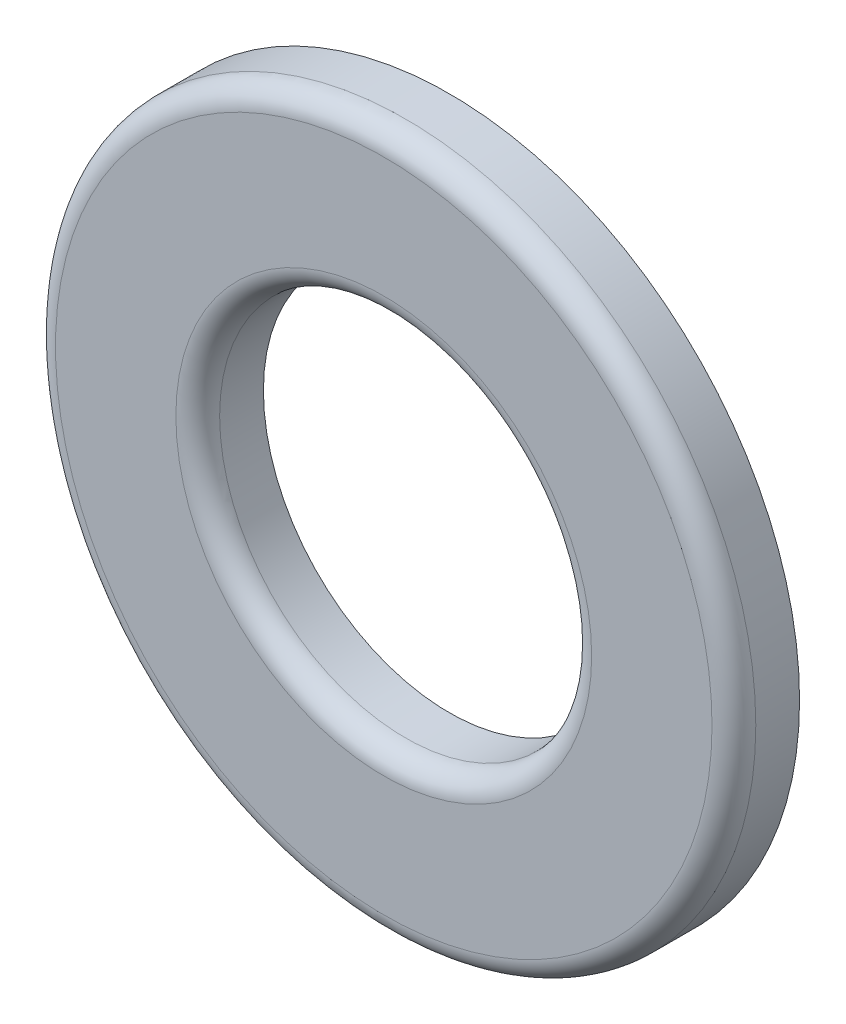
from build123d import *

# Parameters (mm, degrees)
ESQUISSE1_R          = 8
ESQUISSE1_R_2        = 4.25
BASE_EXTRUSION_DEPTH = 1.5
CONG_1_R             = 0.5


with BuildPart() as part:
    # Esquisse1 → Base-Extrusion (new body)
    with BuildSketch(Plane.XY):
        Circle(ESQUISSE1_R)
        Circle(ESQUISSE1_R_2, mode=Mode.SUBTRACT)
    extrude(amount=BASE_EXTRUSION_DEPTH)

    # Cong_1
    cong_1_edges = [part.edges().sort_by_distance(p)[0] for p in [
        (-8, 0, 1.5),
        (-4.25, 0, 1.5),
    ]]
    fillet(cong_1_edges, radius=CONG_1_R)


solid = part.part
